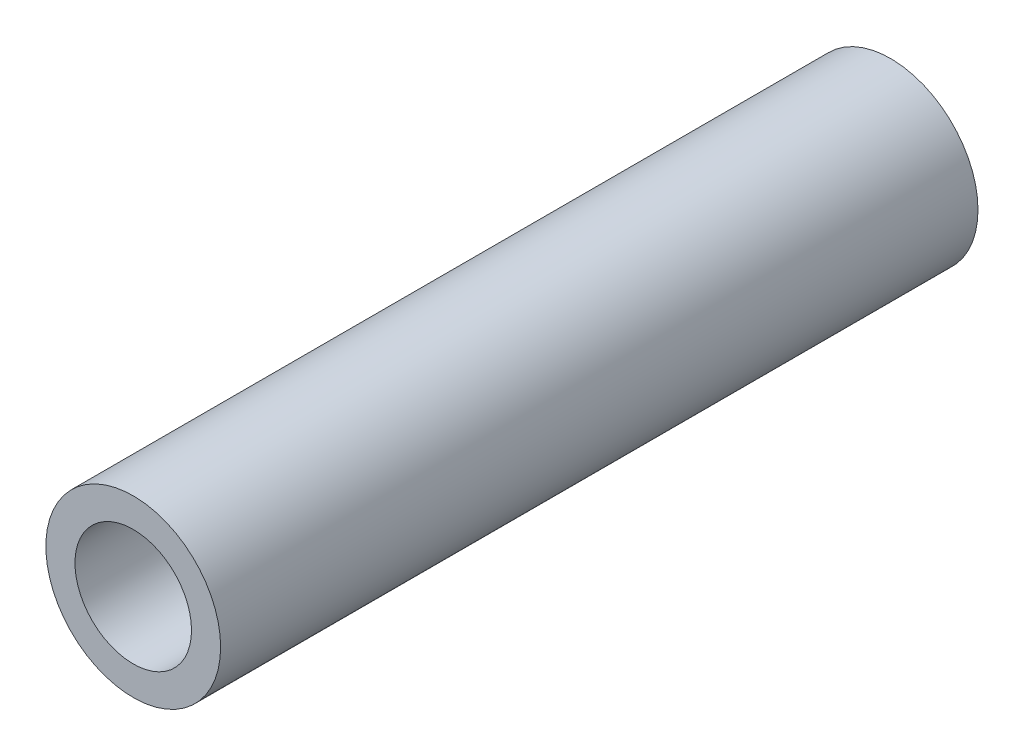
from build123d import *

# Parameters (mm, degrees)
ESQUISSE1_R      = 3
ESQUISSE1_R_2    = 2
EXTRUSION1_DEPTH = 26


with BuildPart() as part:
    # Esquisse1 → Extrusion1 (new body)
    with BuildSketch(Plane.XY):
        Circle(ESQUISSE1_R)
        Circle(ESQUISSE1_R_2, mode=Mode.SUBTRACT)
    extrude(amount=EXTRUSION1_DEPTH)


solid = part.part
